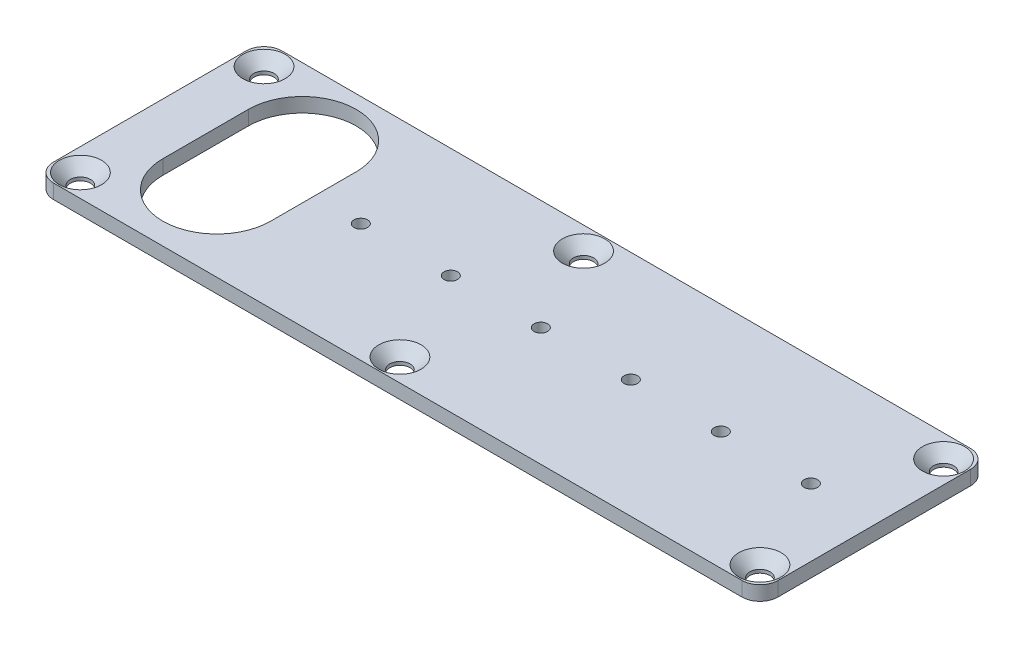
ISO-10303-21;
HEADER;
FILE_DESCRIPTION(('STEP AP214'),'2;1');
FILE_NAME('part.step','',(''),(''),'','','');
FILE_SCHEMA(('AUTOMOTIVE_DESIGN { 1 0 10303 214 1 1 1 1 }'));
ENDSEC;
DATA;
#1=APPLICATION_CONTEXT('core data for automotive mechanical design processes');
#2=APPLICATION_PROTOCOL_DEFINITION('international standard','automotive_design',2000,#1);
#3=PRODUCT_CONTEXT('',#1,'mechanical');
#4=PRODUCT('Part','Part','',(#3));
#5=PRODUCT_RELATED_PRODUCT_CATEGORY('part','',(#4));
#6=PRODUCT_DEFINITION_FORMATION('','',#4);
#7=PRODUCT_DEFINITION_CONTEXT('part definition',#1,'design');
#8=PRODUCT_DEFINITION('design','',#6,#7);
#9=PRODUCT_DEFINITION_SHAPE('','',#8);
#10=(LENGTH_UNIT() NAMED_UNIT(*) SI_UNIT(.MILLI.,.METRE.));
#11=(NAMED_UNIT(*) PLANE_ANGLE_UNIT() SI_UNIT($,.RADIAN.));
#12=(NAMED_UNIT(*) SI_UNIT($,.STERADIAN.) SOLID_ANGLE_UNIT());
#13=UNCERTAINTY_MEASURE_WITH_UNIT(LENGTH_MEASURE(1.E-05),#10,'distance_accuracy_value','');
#14=(GEOMETRIC_REPRESENTATION_CONTEXT(3) GLOBAL_UNCERTAINTY_ASSIGNED_CONTEXT((#13)) GLOBAL_UNIT_ASSIGNED_CONTEXT((#10,
#11,#12)) REPRESENTATION_CONTEXT('',''));
#15=CARTESIAN_POINT('',(0.,0.,0.));
#16=DIRECTION('',(0.,0.,1.));
#17=DIRECTION('',(1.,0.,0.));
#18=AXIS2_PLACEMENT_3D('',#15,#16,#17);
#19=CARTESIAN_POINT('',(0.,3.2,0.));
#20=DIRECTION('',(1.,0.,0.));
#21=DIRECTION('',(0.,0.,-1.));
#22=AXIS2_PLACEMENT_3D('',#19,#20,#21);
#23=PLANE('',#22);
#24=DIRECTION('',(0.,0.,1.));
#25=VECTOR('',#24,1.);
#26=CARTESIAN_POINT('',(0.,0.,0.));
#27=LINE('',#26,#25);
#28=CARTESIAN_POINT('',(0.,0.,-46.8));
#29=VERTEX_POINT('',#28);
#30=CARTESIAN_POINT('',(0.,0.,-4.));
#31=VERTEX_POINT('',#30);
#32=EDGE_CURVE('E207',#29,#31,#27,.T.);
#33=ORIENTED_EDGE('',*,*,#32,.T.);
#34=DIRECTION('',(0.,-1.,0.));
#35=VECTOR('',#34,1.);
#36=CARTESIAN_POINT('',(0.,3.2,-4.));
#37=LINE('',#36,#35);
#38=CARTESIAN_POINT('',(0.,3.2,-4.));
#39=VERTEX_POINT('',#38);
#40=EDGE_CURVE('E258',#31,#39,#37,.F.);
#41=ORIENTED_EDGE('',*,*,#40,.T.);
#42=DIRECTION('',(0.,0.,1.));
#43=VECTOR('',#42,1.);
#44=CARTESIAN_POINT('',(0.,3.2,0.));
#45=LINE('',#44,#43);
#46=CARTESIAN_POINT('',(0.,3.2,-46.8));
#47=VERTEX_POINT('',#46);
#48=EDGE_CURVE('E210',#47,#39,#45,.T.);
#49=ORIENTED_EDGE('',*,*,#48,.F.);
#50=DIRECTION('',(0.,-1.,0.));
#51=VECTOR('',#50,1.);
#52=CARTESIAN_POINT('',(0.,3.2,-46.8));
#53=LINE('',#52,#51);
#54=EDGE_CURVE('E255',#47,#29,#53,.T.);
#55=ORIENTED_EDGE('',*,*,#54,.T.);
#56=EDGE_LOOP('',(#33,#41,#49,#55));
#57=FACE_BOUND('',#56,.T.);
#58=ADVANCED_FACE('F35',(#57),#23,.F.);
#59=CARTESIAN_POINT('',(0.,3.2,0.));
#60=DIRECTION('',(0.,0.,-1.));
#61=DIRECTION('',(-1.,0.,0.));
#62=AXIS2_PLACEMENT_3D('',#59,#60,#61);
#63=PLANE('',#62);
#64=DIRECTION('',(1.,0.,0.));
#65=VECTOR('',#64,1.);
#66=CARTESIAN_POINT('',(0.,0.,0.));
#67=LINE('',#66,#65);
#68=CARTESIAN_POINT('',(4.,0.,0.));
#69=VERTEX_POINT('',#68);
#70=CARTESIAN_POINT('',(157.,0.,0.));
#71=VERTEX_POINT('',#70);
#72=EDGE_CURVE('E224',#69,#71,#67,.T.);
#73=ORIENTED_EDGE('',*,*,#72,.T.);
#74=DIRECTION('',(0.,-1.,0.));
#75=VECTOR('',#74,1.);
#76=CARTESIAN_POINT('',(157.,3.2,0.));
#77=LINE('',#76,#75);
#78=CARTESIAN_POINT('',(157.,3.2,0.));
#79=VERTEX_POINT('',#78);
#80=EDGE_CURVE('E246',#71,#79,#77,.F.);
#81=ORIENTED_EDGE('',*,*,#80,.T.);
#82=DIRECTION('',(1.,0.,0.));
#83=VECTOR('',#82,1.);
#84=CARTESIAN_POINT('',(0.,3.2,0.));
#85=LINE('',#84,#83);
#86=CARTESIAN_POINT('',(4.,3.2,0.));
#87=VERTEX_POINT('',#86);
#88=EDGE_CURVE('E213',#87,#79,#85,.T.);
#89=ORIENTED_EDGE('',*,*,#88,.F.);
#90=DIRECTION('',(0.,-1.,0.));
#91=VECTOR('',#90,1.);
#92=CARTESIAN_POINT('',(4.,3.2,0.));
#93=LINE('',#92,#91);
#94=EDGE_CURVE('E243',#87,#69,#93,.T.);
#95=ORIENTED_EDGE('',*,*,#94,.T.);
#96=EDGE_LOOP('',(#73,#81,#89,#95));
#97=FACE_BOUND('',#96,.T.);
#98=ADVANCED_FACE('F326',(#97),#63,.F.);
#99=CARTESIAN_POINT('',(161.,3.2,0.));
#100=DIRECTION('',(-1.,0.,0.));
#101=DIRECTION('',(0.,0.,1.));
#102=AXIS2_PLACEMENT_3D('',#99,#100,#101);
#103=PLANE('',#102);
#104=DIRECTION('',(0.,0.,-1.));
#105=VECTOR('',#104,1.);
#106=CARTESIAN_POINT('',(161.,3.2,0.));
#107=LINE('',#106,#105);
#108=CARTESIAN_POINT('',(161.,3.2,-4.));
#109=VERTEX_POINT('',#108);
#110=CARTESIAN_POINT('',(161.,3.2,-46.8));
#111=VERTEX_POINT('',#110);
#112=EDGE_CURVE('E217',#109,#111,#107,.T.);
#113=ORIENTED_EDGE('',*,*,#112,.F.);
#114=DIRECTION('',(0.,-1.,0.));
#115=VECTOR('',#114,1.);
#116=CARTESIAN_POINT('',(161.,3.2,-4.));
#117=LINE('',#116,#115);
#118=CARTESIAN_POINT('',(161.,0.,-4.));
#119=VERTEX_POINT('',#118);
#120=EDGE_CURVE('E232',#109,#119,#117,.T.);
#121=ORIENTED_EDGE('',*,*,#120,.T.);
#122=DIRECTION('',(0.,0.,-1.));
#123=VECTOR('',#122,1.);
#124=CARTESIAN_POINT('',(161.,0.,0.));
#125=LINE('',#124,#123);
#126=CARTESIAN_POINT('',(161.,0.,-46.8));
#127=VERTEX_POINT('',#126);
#128=EDGE_CURVE('E227',#119,#127,#125,.T.);
#129=ORIENTED_EDGE('',*,*,#128,.T.);
#130=DIRECTION('',(0.,-1.,0.));
#131=VECTOR('',#130,1.);
#132=CARTESIAN_POINT('',(161.,3.2,-46.8));
#133=LINE('',#132,#131);
#134=EDGE_CURVE('E221',#127,#111,#133,.F.);
#135=ORIENTED_EDGE('',*,*,#134,.T.);
#136=EDGE_LOOP('',(#113,#121,#129,#135));
#137=FACE_BOUND('',#136,.T.);
#138=ADVANCED_FACE('F332',(#137),#103,.F.);
#139=CARTESIAN_POINT('',(0.,3.2,-50.8));
#140=DIRECTION('',(0.,0.,1.));
#141=DIRECTION('',(1.,0.,0.));
#142=AXIS2_PLACEMENT_3D('',#139,#140,#141);
#143=PLANE('',#142);
#144=DIRECTION('',(-1.,0.,0.));
#145=VECTOR('',#144,1.);
#146=CARTESIAN_POINT('',(0.,0.,-50.8));
#147=LINE('',#146,#145);
#148=CARTESIAN_POINT('',(157.,0.,-50.8));
#149=VERTEX_POINT('',#148);
#150=CARTESIAN_POINT('',(4.,0.,-50.8));
#151=VERTEX_POINT('',#150);
#152=EDGE_CURVE('E214',#149,#151,#147,.T.);
#153=ORIENTED_EDGE('',*,*,#152,.T.);
#154=DIRECTION('',(0.,-1.,0.));
#155=VECTOR('',#154,1.);
#156=CARTESIAN_POINT('',(4.,3.2,-50.8));
#157=LINE('',#156,#155);
#158=CARTESIAN_POINT('',(4.,3.2,-50.8));
#159=VERTEX_POINT('',#158);
#160=EDGE_CURVE('E11',#151,#159,#157,.F.);
#161=ORIENTED_EDGE('',*,*,#160,.T.);
#162=DIRECTION('',(-1.,0.,0.));
#163=VECTOR('',#162,1.);
#164=CARTESIAN_POINT('',(0.,3.2,-50.8));
#165=LINE('',#164,#163);
#166=CARTESIAN_POINT('',(157.,3.2,-50.8));
#167=VERTEX_POINT('',#166);
#168=EDGE_CURVE('E219',#167,#159,#165,.T.);
#169=ORIENTED_EDGE('',*,*,#168,.F.);
#170=DIRECTION('',(0.,-1.,0.));
#171=VECTOR('',#170,1.);
#172=CARTESIAN_POINT('',(157.,3.2,-50.8));
#173=LINE('',#172,#171);
#174=EDGE_CURVE('E44',#167,#149,#173,.T.);
#175=ORIENTED_EDGE('',*,*,#174,.T.);
#176=EDGE_LOOP('',(#153,#161,#169,#175));
#177=FACE_BOUND('',#176,.T.);
#178=ADVANCED_FACE('F370',(#177),#143,.F.);
#179=CARTESIAN_POINT('',(0.,3.2,0.));
#180=DIRECTION('',(0.,-1.,0.));
#181=DIRECTION('',(0.,0.,-1.));
#182=AXIS2_PLACEMENT_3D('',#179,#180,#181);
#183=PLANE('',#182);
#184=CARTESIAN_POINT('',(156.,3.2,-5.));
#185=DIRECTION('',(0.,1.,0.));
#186=DIRECTION('',(0.,0.,1.));
#187=AXIS2_PLACEMENT_3D('',#184,#185,#186);
#188=CIRCLE('',#187,4.70000000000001);
#189=CARTESIAN_POINT('',(156.,3.2,-0.29999999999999));
#190=VERTEX_POINT('',#189);
#191=EDGE_CURVE('E611',#190,#190,#188,.T.);
#192=ORIENTED_EDGE('',*,*,#191,.F.);
#193=EDGE_LOOP('',(#192));
#194=FACE_BOUND('',#193,.T.);
#195=CARTESIAN_POINT('',(76.,3.2,-5.));
#196=DIRECTION('',(0.,1.,0.));
#197=DIRECTION('',(0.,0.,1.));
#198=AXIS2_PLACEMENT_3D('',#195,#196,#197);
#199=CIRCLE('',#198,4.7);
#200=CARTESIAN_POINT('',(76.,3.2,-0.300000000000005));
#201=VERTEX_POINT('',#200);
#202=EDGE_CURVE('E287',#201,#201,#199,.T.);
#203=ORIENTED_EDGE('',*,*,#202,.F.);
#204=EDGE_LOOP('',(#203));
#205=FACE_BOUND('',#204,.T.);
#206=CARTESIAN_POINT('',(5.,3.2,-5.));
#207=DIRECTION('',(0.,1.,0.));
#208=DIRECTION('',(0.,0.,1.));
#209=AXIS2_PLACEMENT_3D('',#206,#207,#208);
#210=CIRCLE('',#209,4.7);
#211=CARTESIAN_POINT('',(5.,3.2,-0.300000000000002));
#212=VERTEX_POINT('',#211);
#213=EDGE_CURVE('E280',#212,#212,#210,.T.);
#214=ORIENTED_EDGE('',*,*,#213,.F.);
#215=EDGE_LOOP('',(#214));
#216=FACE_BOUND('',#215,.T.);
#217=CARTESIAN_POINT('',(5.,3.2,-45.8));
#218=DIRECTION('',(0.,1.,0.));
#219=DIRECTION('',(0.,0.,1.));
#220=AXIS2_PLACEMENT_3D('',#217,#218,#219);
#221=CIRCLE('',#220,4.7);
#222=CARTESIAN_POINT('',(5.,3.2,-41.1));
#223=VERTEX_POINT('',#222);
#224=EDGE_CURVE('E276',#223,#223,#221,.T.);
#225=ORIENTED_EDGE('',*,*,#224,.F.);
#226=EDGE_LOOP('',(#225));
#227=FACE_BOUND('',#226,.T.);
#228=CARTESIAN_POINT('',(76.,3.2,-45.8));
#229=DIRECTION('',(0.,1.,0.));
#230=DIRECTION('',(0.,0.,1.));
#231=AXIS2_PLACEMENT_3D('',#228,#229,#230);
#232=CIRCLE('',#231,4.7);
#233=CARTESIAN_POINT('',(76.,3.2,-41.1));
#234=VERTEX_POINT('',#233);
#235=EDGE_CURVE('E272',#234,#234,#232,.T.);
#236=ORIENTED_EDGE('',*,*,#235,.F.);
#237=EDGE_LOOP('',(#236));
#238=FACE_BOUND('',#237,.T.);
#239=CARTESIAN_POINT('',(156.,3.2,-45.8));
#240=DIRECTION('',(0.,1.,0.));
#241=DIRECTION('',(0.,0.,1.));
#242=AXIS2_PLACEMENT_3D('',#239,#240,#241);
#243=CIRCLE('',#242,4.70000000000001);
#244=CARTESIAN_POINT('',(156.,3.2,-41.1));
#245=VERTEX_POINT('',#244);
#246=EDGE_CURVE('E267',#245,#245,#243,.T.);
#247=ORIENTED_EDGE('',*,*,#246,.F.);
#248=EDGE_LOOP('',(#247));
#249=FACE_BOUND('',#248,.T.);
#250=DIRECTION('',(0.,0.,1.));
#251=VECTOR('',#250,1.);
#252=CARTESIAN_POINT('',(11.5,3.2,-35.8));
#253=LINE('',#252,#251);
#254=CARTESIAN_POINT('',(11.5,3.2,-35.8));
#255=VERTEX_POINT('',#254);
#256=CARTESIAN_POINT('',(11.5,3.2,-16.8));
#257=VERTEX_POINT('',#256);
#258=EDGE_CURVE('E163',#255,#257,#253,.T.);
#259=ORIENTED_EDGE('',*,*,#258,.F.);
#260=CARTESIAN_POINT('',(23.5,3.2,-35.8));
#261=DIRECTION('',(0.,1.,0.));
#262=DIRECTION('',(0.,0.,1.));
#263=AXIS2_PLACEMENT_3D('',#260,#261,#262);
#264=CIRCLE('',#263,12.);
#265=CARTESIAN_POINT('',(35.5,3.2,-35.8));
#266=VERTEX_POINT('',#265);
#267=EDGE_CURVE('E133',#266,#255,#264,.T.);
#268=ORIENTED_EDGE('',*,*,#267,.F.);
#269=DIRECTION('',(0.,0.,-1.));
#270=VECTOR('',#269,1.);
#271=CARTESIAN_POINT('',(35.5,3.2,-35.8));
#272=LINE('',#271,#270);
#273=CARTESIAN_POINT('',(35.5,3.2,-16.8));
#274=VERTEX_POINT('',#273);
#275=EDGE_CURVE('E151',#274,#266,#272,.T.);
#276=ORIENTED_EDGE('',*,*,#275,.F.);
#277=CARTESIAN_POINT('',(23.5,3.2,-16.8));
#278=DIRECTION('',(0.,1.,0.));
#279=DIRECTION('',(0.,0.,1.));
#280=AXIS2_PLACEMENT_3D('',#277,#278,#279);
#281=CIRCLE('',#280,12.);
#282=EDGE_CURVE('E154',#257,#274,#281,.T.);
#283=ORIENTED_EDGE('',*,*,#282,.F.);
#284=EDGE_LOOP('',(#259,#268,#276,#283));
#285=FACE_BOUND('',#284,.T.);
#286=CARTESIAN_POINT('',(46.,3.2,-26.3));
#287=DIRECTION('',(0.,1.,0.));
#288=DIRECTION('',(0.,0.,1.));
#289=AXIS2_PLACEMENT_3D('',#286,#287,#288);
#290=CIRCLE('',#289,1.5);
#291=CARTESIAN_POINT('',(46.,3.2,-24.8));
#292=VERTEX_POINT('',#291);
#293=EDGE_CURVE('E170',#292,#292,#290,.T.);
#294=ORIENTED_EDGE('',*,*,#293,.F.);
#295=EDGE_LOOP('',(#294));
#296=FACE_BOUND('',#295,.T.);
#297=CARTESIAN_POINT('',(66.,3.2,-26.3));
#298=DIRECTION('',(0.,1.,0.));
#299=DIRECTION('',(0.,0.,1.));
#300=AXIS2_PLACEMENT_3D('',#297,#298,#299);
#301=CIRCLE('',#300,1.5);
#302=CARTESIAN_POINT('',(66.,3.2,-24.8));
#303=VERTEX_POINT('',#302);
#304=EDGE_CURVE('E177',#303,#303,#301,.T.);
#305=ORIENTED_EDGE('',*,*,#304,.F.);
#306=EDGE_LOOP('',(#305));
#307=FACE_BOUND('',#306,.T.);
#308=CARTESIAN_POINT('',(86.,3.2,-26.3));
#309=DIRECTION('',(0.,1.,0.));
#310=DIRECTION('',(0.,0.,1.));
#311=AXIS2_PLACEMENT_3D('',#308,#309,#310);
#312=CIRCLE('',#311,1.5);
#313=CARTESIAN_POINT('',(86.,3.2,-24.8));
#314=VERTEX_POINT('',#313);
#315=EDGE_CURVE('E183',#314,#314,#312,.T.);
#316=ORIENTED_EDGE('',*,*,#315,.F.);
#317=EDGE_LOOP('',(#316));
#318=FACE_BOUND('',#317,.T.);
#319=CARTESIAN_POINT('',(126.,3.2,-26.3));
#320=DIRECTION('',(0.,1.,0.));
#321=DIRECTION('',(0.,0.,1.));
#322=AXIS2_PLACEMENT_3D('',#319,#320,#321);
#323=CIRCLE('',#322,1.5);
#324=CARTESIAN_POINT('',(126.,3.2,-24.8));
#325=VERTEX_POINT('',#324);
#326=EDGE_CURVE('E189',#325,#325,#323,.T.);
#327=ORIENTED_EDGE('',*,*,#326,.F.);
#328=EDGE_LOOP('',(#327));
#329=FACE_BOUND('',#328,.T.);
#330=CARTESIAN_POINT('',(106.,3.2,-26.3));
#331=DIRECTION('',(0.,1.,0.));
#332=DIRECTION('',(0.,0.,1.));
#333=AXIS2_PLACEMENT_3D('',#330,#331,#332);
#334=CIRCLE('',#333,1.5);
#335=CARTESIAN_POINT('',(106.,3.2,-24.8));
#336=VERTEX_POINT('',#335);
#337=EDGE_CURVE('E195',#336,#336,#334,.T.);
#338=ORIENTED_EDGE('',*,*,#337,.F.);
#339=EDGE_LOOP('',(#338));
#340=FACE_BOUND('',#339,.T.);
#341=CARTESIAN_POINT('',(146.,3.2,-26.3));
#342=DIRECTION('',(0.,1.,0.));
#343=DIRECTION('',(0.,0.,1.));
#344=AXIS2_PLACEMENT_3D('',#341,#342,#343);
#345=CIRCLE('',#344,1.5);
#346=CARTESIAN_POINT('',(146.,3.2,-24.8));
#347=VERTEX_POINT('',#346);
#348=EDGE_CURVE('E201',#347,#347,#345,.T.);
#349=ORIENTED_EDGE('',*,*,#348,.F.);
#350=EDGE_LOOP('',(#349));
#351=FACE_BOUND('',#350,.T.);
#352=ORIENTED_EDGE('',*,*,#88,.T.);
#353=CARTESIAN_POINT('',(157.,3.2,-4.));
#354=DIRECTION('',(0.,-1.,0.));
#355=DIRECTION('',(0.,0.,-1.));
#356=AXIS2_PLACEMENT_3D('',#353,#354,#355);
#357=CIRCLE('',#356,4.);
#358=EDGE_CURVE('E253',#79,#109,#357,.F.);
#359=ORIENTED_EDGE('',*,*,#358,.T.);
#360=ORIENTED_EDGE('',*,*,#112,.T.);
#361=CARTESIAN_POINT('',(157.,3.2,-46.8));
#362=DIRECTION('',(0.,-1.,0.));
#363=DIRECTION('',(0.,0.,-1.));
#364=AXIS2_PLACEMENT_3D('',#361,#362,#363);
#365=CIRCLE('',#364,4.);
#366=EDGE_CURVE('E57',#111,#167,#365,.F.);
#367=ORIENTED_EDGE('',*,*,#366,.T.);
#368=ORIENTED_EDGE('',*,*,#168,.T.);
#369=CARTESIAN_POINT('',(4.,3.2,-46.8));
#370=DIRECTION('',(0.,-1.,0.));
#371=DIRECTION('',(0.,0.,-1.));
#372=AXIS2_PLACEMENT_3D('',#369,#370,#371);
#373=CIRCLE('',#372,4.);
#374=EDGE_CURVE('E249',#159,#47,#373,.F.);
#375=ORIENTED_EDGE('',*,*,#374,.T.);
#376=ORIENTED_EDGE('',*,*,#48,.T.);
#377=CARTESIAN_POINT('',(4.,3.2,-4.));
#378=DIRECTION('',(0.,-1.,0.));
#379=DIRECTION('',(0.,0.,-1.));
#380=AXIS2_PLACEMENT_3D('',#377,#378,#379);
#381=CIRCLE('',#380,4.);
#382=EDGE_CURVE('E251',#39,#87,#381,.F.);
#383=ORIENTED_EDGE('',*,*,#382,.T.);
#384=EDGE_LOOP('',(#352,#359,#360,#367,#368,#375,#376,#383));
#385=FACE_BOUND('',#384,.T.);
#386=ADVANCED_FACE('F354',(#194,#205,#216,#227,#238,#249,#285,#296,#307,#318,#329,#340,#351,
#385),#183,.F.);
#387=CARTESIAN_POINT('',(0.,0.,0.));
#388=DIRECTION('',(0.,-1.,0.));
#389=DIRECTION('',(0.,0.,-1.));
#390=AXIS2_PLACEMENT_3D('',#387,#388,#389);
#391=PLANE('',#390);
#392=CARTESIAN_POINT('',(156.,0.,-5.));
#393=DIRECTION('',(0.,-1.,0.));
#394=DIRECTION('',(0.,0.,-1.));
#395=AXIS2_PLACEMENT_3D('',#392,#393,#394);
#396=CIRCLE('',#395,2.25);
#397=CARTESIAN_POINT('',(156.,0.,-7.25));
#398=VERTEX_POINT('',#397);
#399=EDGE_CURVE('E39',#398,#398,#396,.T.);
#400=ORIENTED_EDGE('',*,*,#399,.F.);
#401=EDGE_LOOP('',(#400));
#402=FACE_BOUND('',#401,.T.);
#403=CARTESIAN_POINT('',(76.,0.,-5.));
#404=DIRECTION('',(0.,-1.,0.));
#405=DIRECTION('',(0.,0.,-1.));
#406=AXIS2_PLACEMENT_3D('',#403,#404,#405);
#407=CIRCLE('',#406,2.25);
#408=CARTESIAN_POINT('',(76.,0.,-7.25));
#409=VERTEX_POINT('',#408);
#410=EDGE_CURVE('E278',#409,#409,#407,.T.);
#411=ORIENTED_EDGE('',*,*,#410,.F.);
#412=EDGE_LOOP('',(#411));
#413=FACE_BOUND('',#412,.T.);
#414=CARTESIAN_POINT('',(5.,0.,-5.));
#415=DIRECTION('',(0.,-1.,0.));
#416=DIRECTION('',(0.,0.,-1.));
#417=AXIS2_PLACEMENT_3D('',#414,#415,#416);
#418=CIRCLE('',#417,2.24999999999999);
#419=CARTESIAN_POINT('',(5.,0.,-7.25));
#420=VERTEX_POINT('',#419);
#421=EDGE_CURVE('E274',#420,#420,#418,.T.);
#422=ORIENTED_EDGE('',*,*,#421,.F.);
#423=EDGE_LOOP('',(#422));
#424=FACE_BOUND('',#423,.T.);
#425=CARTESIAN_POINT('',(5.,0.,-45.8));
#426=DIRECTION('',(0.,-1.,0.));
#427=DIRECTION('',(0.,0.,-1.));
#428=AXIS2_PLACEMENT_3D('',#425,#426,#427);
#429=CIRCLE('',#428,2.24999999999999);
#430=CARTESIAN_POINT('',(5.,0.,-48.05));
#431=VERTEX_POINT('',#430);
#432=EDGE_CURVE('E269',#431,#431,#429,.T.);
#433=ORIENTED_EDGE('',*,*,#432,.F.);
#434=EDGE_LOOP('',(#433));
#435=FACE_BOUND('',#434,.T.);
#436=CARTESIAN_POINT('',(76.,0.,-45.8));
#437=DIRECTION('',(0.,-1.,0.));
#438=DIRECTION('',(0.,0.,-1.));
#439=AXIS2_PLACEMENT_3D('',#436,#437,#438);
#440=CIRCLE('',#439,2.25);
#441=CARTESIAN_POINT('',(76.,0.,-48.05));
#442=VERTEX_POINT('',#441);
#443=EDGE_CURVE('E264',#442,#442,#440,.T.);
#444=ORIENTED_EDGE('',*,*,#443,.F.);
#445=EDGE_LOOP('',(#444));
#446=FACE_BOUND('',#445,.T.);
#447=CARTESIAN_POINT('',(156.,0.,-45.8));
#448=DIRECTION('',(0.,-1.,0.));
#449=DIRECTION('',(0.,0.,-1.));
#450=AXIS2_PLACEMENT_3D('',#447,#448,#449);
#451=CIRCLE('',#450,2.25);
#452=CARTESIAN_POINT('',(156.,0.,-48.05));
#453=VERTEX_POINT('',#452);
#454=EDGE_CURVE('E164',#453,#453,#451,.T.);
#455=ORIENTED_EDGE('',*,*,#454,.F.);
#456=EDGE_LOOP('',(#455));
#457=FACE_BOUND('',#456,.T.);
#458=CARTESIAN_POINT('',(23.5,0.,-35.8));
#459=DIRECTION('',(0.,1.,0.));
#460=DIRECTION('',(0.,0.,1.));
#461=AXIS2_PLACEMENT_3D('',#458,#459,#460);
#462=CIRCLE('',#461,12.);
#463=CARTESIAN_POINT('',(35.5,0.,-35.8));
#464=VERTEX_POINT('',#463);
#465=CARTESIAN_POINT('',(11.5,0.,-35.8));
#466=VERTEX_POINT('',#465);
#467=EDGE_CURVE('E130',#464,#466,#462,.T.);
#468=ORIENTED_EDGE('',*,*,#467,.T.);
#469=DIRECTION('',(0.,0.,1.));
#470=VECTOR('',#469,1.);
#471=CARTESIAN_POINT('',(11.5,0.,-35.8));
#472=LINE('',#471,#470);
#473=CARTESIAN_POINT('',(11.5,0.,-16.8));
#474=VERTEX_POINT('',#473);
#475=EDGE_CURVE('E142',#466,#474,#472,.T.);
#476=ORIENTED_EDGE('',*,*,#475,.T.);
#477=CARTESIAN_POINT('',(23.5,0.,-16.8));
#478=DIRECTION('',(0.,1.,0.));
#479=DIRECTION('',(0.,0.,1.));
#480=AXIS2_PLACEMENT_3D('',#477,#478,#479);
#481=CIRCLE('',#480,12.);
#482=CARTESIAN_POINT('',(35.5,0.,-16.8));
#483=VERTEX_POINT('',#482);
#484=EDGE_CURVE('E146',#474,#483,#481,.T.);
#485=ORIENTED_EDGE('',*,*,#484,.T.);
#486=DIRECTION('',(0.,0.,-1.));
#487=VECTOR('',#486,1.);
#488=CARTESIAN_POINT('',(35.5,0.,-35.8));
#489=LINE('',#488,#487);
#490=EDGE_CURVE('E138',#483,#464,#489,.T.);
#491=ORIENTED_EDGE('',*,*,#490,.T.);
#492=EDGE_LOOP('',(#468,#476,#485,#491));
#493=FACE_BOUND('',#492,.T.);
#494=CARTESIAN_POINT('',(46.,0.,-26.3));
#495=DIRECTION('',(0.,1.,0.));
#496=DIRECTION('',(0.,0.,1.));
#497=AXIS2_PLACEMENT_3D('',#494,#495,#496);
#498=CIRCLE('',#497,1.5);
#499=CARTESIAN_POINT('',(46.,0.,-24.8));
#500=VERTEX_POINT('',#499);
#501=EDGE_CURVE('E174',#500,#500,#498,.T.);
#502=ORIENTED_EDGE('',*,*,#501,.T.);
#503=EDGE_LOOP('',(#502));
#504=FACE_BOUND('',#503,.T.);
#505=CARTESIAN_POINT('',(66.,0.,-26.3));
#506=DIRECTION('',(0.,1.,0.));
#507=DIRECTION('',(0.,0.,1.));
#508=AXIS2_PLACEMENT_3D('',#505,#506,#507);
#509=CIRCLE('',#508,1.5);
#510=CARTESIAN_POINT('',(66.,0.,-24.8));
#511=VERTEX_POINT('',#510);
#512=EDGE_CURVE('E180',#511,#511,#509,.T.);
#513=ORIENTED_EDGE('',*,*,#512,.T.);
#514=EDGE_LOOP('',(#513));
#515=FACE_BOUND('',#514,.T.);
#516=CARTESIAN_POINT('',(86.,0.,-26.3));
#517=DIRECTION('',(0.,1.,0.));
#518=DIRECTION('',(0.,0.,1.));
#519=AXIS2_PLACEMENT_3D('',#516,#517,#518);
#520=CIRCLE('',#519,1.5);
#521=CARTESIAN_POINT('',(86.,0.,-24.8));
#522=VERTEX_POINT('',#521);
#523=EDGE_CURVE('E186',#522,#522,#520,.T.);
#524=ORIENTED_EDGE('',*,*,#523,.T.);
#525=EDGE_LOOP('',(#524));
#526=FACE_BOUND('',#525,.T.);
#527=CARTESIAN_POINT('',(126.,0.,-26.3));
#528=DIRECTION('',(0.,1.,0.));
#529=DIRECTION('',(0.,0.,1.));
#530=AXIS2_PLACEMENT_3D('',#527,#528,#529);
#531=CIRCLE('',#530,1.5);
#532=CARTESIAN_POINT('',(126.,0.,-24.8));
#533=VERTEX_POINT('',#532);
#534=EDGE_CURVE('E192',#533,#533,#531,.T.);
#535=ORIENTED_EDGE('',*,*,#534,.T.);
#536=EDGE_LOOP('',(#535));
#537=FACE_BOUND('',#536,.T.);
#538=CARTESIAN_POINT('',(106.,0.,-26.3));
#539=DIRECTION('',(0.,1.,0.));
#540=DIRECTION('',(0.,0.,1.));
#541=AXIS2_PLACEMENT_3D('',#538,#539,#540);
#542=CIRCLE('',#541,1.5);
#543=CARTESIAN_POINT('',(106.,0.,-24.8));
#544=VERTEX_POINT('',#543);
#545=EDGE_CURVE('E198',#544,#544,#542,.T.);
#546=ORIENTED_EDGE('',*,*,#545,.T.);
#547=EDGE_LOOP('',(#546));
#548=FACE_BOUND('',#547,.T.);
#549=CARTESIAN_POINT('',(146.,0.,-26.3));
#550=DIRECTION('',(0.,1.,0.));
#551=DIRECTION('',(0.,0.,1.));
#552=AXIS2_PLACEMENT_3D('',#549,#550,#551);
#553=CIRCLE('',#552,1.5);
#554=CARTESIAN_POINT('',(146.,0.,-24.8));
#555=VERTEX_POINT('',#554);
#556=EDGE_CURVE('E204',#555,#555,#553,.T.);
#557=ORIENTED_EDGE('',*,*,#556,.T.);
#558=EDGE_LOOP('',(#557));
#559=FACE_BOUND('',#558,.T.);
#560=ORIENTED_EDGE('',*,*,#128,.F.);
#561=CARTESIAN_POINT('',(157.,0.,-4.));
#562=DIRECTION('',(0.,-1.,0.));
#563=DIRECTION('',(0.,0.,-1.));
#564=AXIS2_PLACEMENT_3D('',#561,#562,#563);
#565=CIRCLE('',#564,4.);
#566=EDGE_CURVE('E241',#119,#71,#565,.T.);
#567=ORIENTED_EDGE('',*,*,#566,.T.);
#568=ORIENTED_EDGE('',*,*,#72,.F.);
#569=CARTESIAN_POINT('',(4.,0.,-4.));
#570=DIRECTION('',(0.,-1.,0.));
#571=DIRECTION('',(0.,0.,-1.));
#572=AXIS2_PLACEMENT_3D('',#569,#570,#571);
#573=CIRCLE('',#572,4.);
#574=EDGE_CURVE('E239',#69,#31,#573,.T.);
#575=ORIENTED_EDGE('',*,*,#574,.T.);
#576=ORIENTED_EDGE('',*,*,#32,.F.);
#577=CARTESIAN_POINT('',(4.,0.,-46.8));
#578=DIRECTION('',(0.,-1.,0.));
#579=DIRECTION('',(0.,0.,-1.));
#580=AXIS2_PLACEMENT_3D('',#577,#578,#579);
#581=CIRCLE('',#580,4.);
#582=EDGE_CURVE('E237',#29,#151,#581,.T.);
#583=ORIENTED_EDGE('',*,*,#582,.T.);
#584=ORIENTED_EDGE('',*,*,#152,.F.);
#585=CARTESIAN_POINT('',(157.,0.,-46.8));
#586=DIRECTION('',(0.,-1.,0.));
#587=DIRECTION('',(0.,0.,-1.));
#588=AXIS2_PLACEMENT_3D('',#585,#586,#587);
#589=CIRCLE('',#588,4.);
#590=EDGE_CURVE('E235',#149,#127,#589,.T.);
#591=ORIENTED_EDGE('',*,*,#590,.T.);
#592=EDGE_LOOP('',(#560,#567,#568,#575,#576,#583,#584,#591));
#593=FACE_BOUND('',#592,.T.);
#594=ADVANCED_FACE('F148',(#402,#413,#424,#435,#446,#457,#493,#504,#515,#526,#537,#548,#559,
#593),#391,.T.);
#595=CARTESIAN_POINT('',(146.,0.,-26.3));
#596=DIRECTION('',(0.,1.,0.));
#597=DIRECTION('',(0.,0.,1.));
#598=AXIS2_PLACEMENT_3D('',#595,#596,#597);
#599=CYLINDRICAL_SURFACE('',#598,1.5);
#600=ORIENTED_EDGE('',*,*,#556,.F.);
#601=EDGE_LOOP('',(#600));
#602=FACE_BOUND('',#601,.T.);
#603=ORIENTED_EDGE('',*,*,#348,.T.);
#604=EDGE_LOOP('',(#603));
#605=FACE_BOUND('',#604,.T.);
#606=ADVANCED_FACE('F373',(#602,#605),#599,.F.);
#607=CARTESIAN_POINT('',(106.,0.,-26.3));
#608=DIRECTION('',(0.,1.,0.));
#609=DIRECTION('',(0.,0.,1.));
#610=AXIS2_PLACEMENT_3D('',#607,#608,#609);
#611=CYLINDRICAL_SURFACE('',#610,1.5);
#612=ORIENTED_EDGE('',*,*,#545,.F.);
#613=EDGE_LOOP('',(#612));
#614=FACE_BOUND('',#613,.T.);
#615=ORIENTED_EDGE('',*,*,#337,.T.);
#616=EDGE_LOOP('',(#615));
#617=FACE_BOUND('',#616,.T.);
#618=ADVANCED_FACE('F381',(#614,#617),#611,.F.);
#619=CARTESIAN_POINT('',(126.,0.,-26.3));
#620=DIRECTION('',(0.,1.,0.));
#621=DIRECTION('',(0.,0.,1.));
#622=AXIS2_PLACEMENT_3D('',#619,#620,#621);
#623=CYLINDRICAL_SURFACE('',#622,1.5);
#624=ORIENTED_EDGE('',*,*,#534,.F.);
#625=EDGE_LOOP('',(#624));
#626=FACE_BOUND('',#625,.T.);
#627=ORIENTED_EDGE('',*,*,#326,.T.);
#628=EDGE_LOOP('',(#627));
#629=FACE_BOUND('',#628,.T.);
#630=ADVANCED_FACE('F421',(#626,#629),#623,.F.);
#631=CARTESIAN_POINT('',(86.,0.,-26.3));
#632=DIRECTION('',(0.,1.,0.));
#633=DIRECTION('',(0.,0.,1.));
#634=AXIS2_PLACEMENT_3D('',#631,#632,#633);
#635=CYLINDRICAL_SURFACE('',#634,1.5);
#636=ORIENTED_EDGE('',*,*,#523,.F.);
#637=EDGE_LOOP('',(#636));
#638=FACE_BOUND('',#637,.T.);
#639=ORIENTED_EDGE('',*,*,#315,.T.);
#640=EDGE_LOOP('',(#639));
#641=FACE_BOUND('',#640,.T.);
#642=ADVANCED_FACE('F429',(#638,#641),#635,.F.);
#643=CARTESIAN_POINT('',(66.,0.,-26.3));
#644=DIRECTION('',(0.,1.,0.));
#645=DIRECTION('',(0.,0.,1.));
#646=AXIS2_PLACEMENT_3D('',#643,#644,#645);
#647=CYLINDRICAL_SURFACE('',#646,1.5);
#648=ORIENTED_EDGE('',*,*,#512,.F.);
#649=EDGE_LOOP('',(#648));
#650=FACE_BOUND('',#649,.T.);
#651=ORIENTED_EDGE('',*,*,#304,.T.);
#652=EDGE_LOOP('',(#651));
#653=FACE_BOUND('',#652,.T.);
#654=ADVANCED_FACE('F437',(#650,#653),#647,.F.);
#655=CARTESIAN_POINT('',(46.,0.,-26.3));
#656=DIRECTION('',(0.,1.,0.));
#657=DIRECTION('',(0.,0.,1.));
#658=AXIS2_PLACEMENT_3D('',#655,#656,#657);
#659=CYLINDRICAL_SURFACE('',#658,1.5);
#660=ORIENTED_EDGE('',*,*,#501,.F.);
#661=EDGE_LOOP('',(#660));
#662=FACE_BOUND('',#661,.T.);
#663=ORIENTED_EDGE('',*,*,#293,.T.);
#664=EDGE_LOOP('',(#663));
#665=FACE_BOUND('',#664,.T.);
#666=ADVANCED_FACE('F445',(#662,#665),#659,.F.);
#667=CARTESIAN_POINT('',(23.5,0.,-35.8));
#668=DIRECTION('',(0.,1.,0.));
#669=DIRECTION('',(0.,0.,1.));
#670=AXIS2_PLACEMENT_3D('',#667,#668,#669);
#671=CYLINDRICAL_SURFACE('',#670,12.);
#672=ORIENTED_EDGE('',*,*,#267,.T.);
#673=DIRECTION('',(0.,1.,0.));
#674=VECTOR('',#673,1.);
#675=CARTESIAN_POINT('',(11.5,0.,-35.8));
#676=LINE('',#675,#674);
#677=EDGE_CURVE('E126',#466,#255,#676,.T.);
#678=ORIENTED_EDGE('',*,*,#677,.F.);
#679=ORIENTED_EDGE('',*,*,#467,.F.);
#680=DIRECTION('',(0.,1.,0.));
#681=VECTOR('',#680,1.);
#682=CARTESIAN_POINT('',(35.5,0.,-35.8));
#683=LINE('',#682,#681);
#684=EDGE_CURVE('E168',#464,#266,#683,.T.);
#685=ORIENTED_EDGE('',*,*,#684,.T.);
#686=EDGE_LOOP('',(#672,#678,#679,#685));
#687=FACE_BOUND('',#686,.T.);
#688=ADVANCED_FACE('F128',(#687),#671,.F.);
#689=CARTESIAN_POINT('',(35.5,0.,-35.8));
#690=DIRECTION('',(1.,0.,0.));
#691=DIRECTION('',(0.,0.,-1.));
#692=AXIS2_PLACEMENT_3D('',#689,#690,#691);
#693=PLANE('',#692);
#694=ORIENTED_EDGE('',*,*,#275,.T.);
#695=ORIENTED_EDGE('',*,*,#684,.F.);
#696=ORIENTED_EDGE('',*,*,#490,.F.);
#697=DIRECTION('',(0.,1.,0.));
#698=VECTOR('',#697,1.);
#699=CARTESIAN_POINT('',(35.5,0.,-16.8));
#700=LINE('',#699,#698);
#701=EDGE_CURVE('E171',#483,#274,#700,.T.);
#702=ORIENTED_EDGE('',*,*,#701,.T.);
#703=EDGE_LOOP('',(#694,#695,#696,#702));
#704=FACE_BOUND('',#703,.T.);
#705=ADVANCED_FACE('F460',(#704),#693,.F.);
#706=CARTESIAN_POINT('',(23.5,0.,-16.8));
#707=DIRECTION('',(0.,1.,0.));
#708=DIRECTION('',(0.,0.,1.));
#709=AXIS2_PLACEMENT_3D('',#706,#707,#708);
#710=CYLINDRICAL_SURFACE('',#709,12.);
#711=ORIENTED_EDGE('',*,*,#282,.T.);
#712=ORIENTED_EDGE('',*,*,#701,.F.);
#713=ORIENTED_EDGE('',*,*,#484,.F.);
#714=DIRECTION('',(0.,1.,0.));
#715=VECTOR('',#714,1.);
#716=CARTESIAN_POINT('',(11.5,0.,-16.8));
#717=LINE('',#716,#715);
#718=EDGE_CURVE('E137',#474,#257,#717,.T.);
#719=ORIENTED_EDGE('',*,*,#718,.T.);
#720=EDGE_LOOP('',(#711,#712,#713,#719));
#721=FACE_BOUND('',#720,.T.);
#722=ADVANCED_FACE('F467',(#721),#710,.F.);
#723=CARTESIAN_POINT('',(11.5,0.,-35.8));
#724=DIRECTION('',(-1.,0.,0.));
#725=DIRECTION('',(0.,0.,1.));
#726=AXIS2_PLACEMENT_3D('',#723,#724,#725);
#727=PLANE('',#726);
#728=ORIENTED_EDGE('',*,*,#258,.T.);
#729=ORIENTED_EDGE('',*,*,#718,.F.);
#730=ORIENTED_EDGE('',*,*,#475,.F.);
#731=ORIENTED_EDGE('',*,*,#677,.T.);
#732=EDGE_LOOP('',(#728,#729,#730,#731));
#733=FACE_BOUND('',#732,.T.);
#734=ADVANCED_FACE('F143',(#733),#727,.F.);
#735=CARTESIAN_POINT('',(157.,3.2,-4.));
#736=DIRECTION('',(0.,-1.,0.));
#737=DIRECTION('',(0.,0.,-1.));
#738=AXIS2_PLACEMENT_3D('',#735,#736,#737);
#739=CYLINDRICAL_SURFACE('',#738,4.);
#740=ORIENTED_EDGE('',*,*,#358,.F.);
#741=ORIENTED_EDGE('',*,*,#80,.F.);
#742=ORIENTED_EDGE('',*,*,#566,.F.);
#743=ORIENTED_EDGE('',*,*,#120,.F.);
#744=EDGE_LOOP('',(#740,#741,#742,#743));
#745=FACE_BOUND('',#744,.T.);
#746=ADVANCED_FACE('F337',(#745),#739,.T.);
#747=CARTESIAN_POINT('',(4.,3.2,-4.));
#748=DIRECTION('',(0.,-1.,0.));
#749=DIRECTION('',(0.,0.,-1.));
#750=AXIS2_PLACEMENT_3D('',#747,#748,#749);
#751=CYLINDRICAL_SURFACE('',#750,4.);
#752=ORIENTED_EDGE('',*,*,#382,.F.);
#753=ORIENTED_EDGE('',*,*,#40,.F.);
#754=ORIENTED_EDGE('',*,*,#574,.F.);
#755=ORIENTED_EDGE('',*,*,#94,.F.);
#756=EDGE_LOOP('',(#752,#753,#754,#755));
#757=FACE_BOUND('',#756,.T.);
#758=ADVANCED_FACE('F340',(#757),#751,.T.);
#759=CARTESIAN_POINT('',(4.,3.2,-46.8));
#760=DIRECTION('',(0.,-1.,0.));
#761=DIRECTION('',(0.,0.,-1.));
#762=AXIS2_PLACEMENT_3D('',#759,#760,#761);
#763=CYLINDRICAL_SURFACE('',#762,4.);
#764=ORIENTED_EDGE('',*,*,#374,.F.);
#765=ORIENTED_EDGE('',*,*,#160,.F.);
#766=ORIENTED_EDGE('',*,*,#582,.F.);
#767=ORIENTED_EDGE('',*,*,#54,.F.);
#768=EDGE_LOOP('',(#764,#765,#766,#767));
#769=FACE_BOUND('',#768,.T.);
#770=ADVANCED_FACE('F343',(#769),#763,.T.);
#771=CARTESIAN_POINT('',(157.,3.2,-46.8));
#772=DIRECTION('',(0.,-1.,0.));
#773=DIRECTION('',(0.,0.,-1.));
#774=AXIS2_PLACEMENT_3D('',#771,#772,#773);
#775=CYLINDRICAL_SURFACE('',#774,4.);
#776=ORIENTED_EDGE('',*,*,#366,.F.);
#777=ORIENTED_EDGE('',*,*,#134,.F.);
#778=ORIENTED_EDGE('',*,*,#590,.F.);
#779=ORIENTED_EDGE('',*,*,#174,.F.);
#780=EDGE_LOOP('',(#776,#777,#778,#779));
#781=FACE_BOUND('',#780,.T.);
#782=ADVANCED_FACE('F37',(#781),#775,.T.);
#783=CARTESIAN_POINT('',(156.,3.2,-45.8));
#784=DIRECTION('',(0.,1.,0.));
#785=DIRECTION('',(0.,0.,1.));
#786=AXIS2_PLACEMENT_3D('',#783,#784,#785);
#787=CYLINDRICAL_SURFACE('',#786,2.25);
#788=ORIENTED_EDGE('',*,*,#454,.T.);
#789=EDGE_LOOP('',(#788));
#790=FACE_BOUND('',#789,.T.);
#791=CARTESIAN_POINT('',(156.,0.749999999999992,-45.8));
#792=DIRECTION('',(0.,1.,0.));
#793=DIRECTION('',(0.,0.,1.));
#794=AXIS2_PLACEMENT_3D('',#791,#792,#793);
#795=CIRCLE('',#794,2.25);
#796=CARTESIAN_POINT('',(156.,0.749999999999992,-43.55));
#797=VERTEX_POINT('',#796);
#798=EDGE_CURVE('E157',#797,#797,#795,.T.);
#799=ORIENTED_EDGE('',*,*,#798,.T.);
#800=EDGE_LOOP('',(#799));
#801=FACE_BOUND('',#800,.T.);
#802=ADVANCED_FACE('F310',(#790,#801),#787,.F.);
#803=CARTESIAN_POINT('',(156.,3.2,-45.8));
#804=DIRECTION('',(0.,1.,0.));
#805=DIRECTION('',(0.,0.,1.));
#806=AXIS2_PLACEMENT_3D('',#803,#804,#805);
#807=CONICAL_SURFACE('',#806,4.70000000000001,0.785398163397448);
#808=ORIENTED_EDGE('',*,*,#798,.F.);
#809=EDGE_LOOP('',(#808));
#810=FACE_BOUND('',#809,.T.);
#811=ORIENTED_EDGE('',*,*,#246,.T.);
#812=EDGE_LOOP('',(#811));
#813=FACE_BOUND('',#812,.T.);
#814=ADVANCED_FACE('F312',(#810,#813),#807,.F.);
#815=CARTESIAN_POINT('',(76.,3.2,-45.8));
#816=DIRECTION('',(0.,1.,0.));
#817=DIRECTION('',(0.,0.,1.));
#818=AXIS2_PLACEMENT_3D('',#815,#816,#817);
#819=CYLINDRICAL_SURFACE('',#818,2.25);
#820=ORIENTED_EDGE('',*,*,#443,.T.);
#821=EDGE_LOOP('',(#820));
#822=FACE_BOUND('',#821,.T.);
#823=CARTESIAN_POINT('',(76.,0.749999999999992,-45.8));
#824=DIRECTION('',(0.,1.,0.));
#825=DIRECTION('',(0.,0.,1.));
#826=AXIS2_PLACEMENT_3D('',#823,#824,#825);
#827=CIRCLE('',#826,2.24999999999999);
#828=CARTESIAN_POINT('',(76.,0.749999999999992,-43.55));
#829=VERTEX_POINT('',#828);
#830=EDGE_CURVE('E268',#829,#829,#827,.T.);
#831=ORIENTED_EDGE('',*,*,#830,.T.);
#832=EDGE_LOOP('',(#831));
#833=FACE_BOUND('',#832,.T.);
#834=ADVANCED_FACE('F314',(#822,#833),#819,.F.);
#835=CARTESIAN_POINT('',(76.,3.2,-45.8));
#836=DIRECTION('',(0.,1.,0.));
#837=DIRECTION('',(0.,0.,1.));
#838=AXIS2_PLACEMENT_3D('',#835,#836,#837);
#839=CONICAL_SURFACE('',#838,4.7,0.785398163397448);
#840=ORIENTED_EDGE('',*,*,#830,.F.);
#841=EDGE_LOOP('',(#840));
#842=FACE_BOUND('',#841,.T.);
#843=ORIENTED_EDGE('',*,*,#235,.T.);
#844=EDGE_LOOP('',(#843));
#845=FACE_BOUND('',#844,.T.);
#846=ADVANCED_FACE('F320',(#842,#845),#839,.F.);
#847=CARTESIAN_POINT('',(5.,3.2,-45.8));
#848=DIRECTION('',(0.,1.,0.));
#849=DIRECTION('',(0.,0.,1.));
#850=AXIS2_PLACEMENT_3D('',#847,#848,#849);
#851=CYLINDRICAL_SURFACE('',#850,2.24999999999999);
#852=ORIENTED_EDGE('',*,*,#432,.T.);
#853=EDGE_LOOP('',(#852));
#854=FACE_BOUND('',#853,.T.);
#855=CARTESIAN_POINT('',(5.,0.749999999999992,-45.8));
#856=DIRECTION('',(0.,1.,0.));
#857=DIRECTION('',(0.,0.,1.));
#858=AXIS2_PLACEMENT_3D('',#855,#856,#857);
#859=CIRCLE('',#858,2.24999999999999);
#860=CARTESIAN_POINT('',(5.,0.749999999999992,-43.55));
#861=VERTEX_POINT('',#860);
#862=EDGE_CURVE('E273',#861,#861,#859,.T.);
#863=ORIENTED_EDGE('',*,*,#862,.T.);
#864=EDGE_LOOP('',(#863));
#865=FACE_BOUND('',#864,.T.);
#866=ADVANCED_FACE('F522',(#854,#865),#851,.F.);
#867=CARTESIAN_POINT('',(5.,3.2,-45.8));
#868=DIRECTION('',(0.,1.,0.));
#869=DIRECTION('',(0.,0.,1.));
#870=AXIS2_PLACEMENT_3D('',#867,#868,#869);
#871=CONICAL_SURFACE('',#870,4.7,0.785398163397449);
#872=ORIENTED_EDGE('',*,*,#862,.F.);
#873=EDGE_LOOP('',(#872));
#874=FACE_BOUND('',#873,.T.);
#875=ORIENTED_EDGE('',*,*,#224,.T.);
#876=EDGE_LOOP('',(#875));
#877=FACE_BOUND('',#876,.T.);
#878=ADVANCED_FACE('F532',(#874,#877),#871,.F.);
#879=CARTESIAN_POINT('',(5.,3.2,-5.));
#880=DIRECTION('',(0.,1.,0.));
#881=DIRECTION('',(0.,0.,1.));
#882=AXIS2_PLACEMENT_3D('',#879,#880,#881);
#883=CYLINDRICAL_SURFACE('',#882,2.24999999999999);
#884=ORIENTED_EDGE('',*,*,#421,.T.);
#885=EDGE_LOOP('',(#884));
#886=FACE_BOUND('',#885,.T.);
#887=CARTESIAN_POINT('',(5.,0.749999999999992,-5.));
#888=DIRECTION('',(0.,1.,0.));
#889=DIRECTION('',(0.,0.,1.));
#890=AXIS2_PLACEMENT_3D('',#887,#888,#889);
#891=CIRCLE('',#890,2.24999999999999);
#892=CARTESIAN_POINT('',(5.,0.749999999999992,-2.75000000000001));
#893=VERTEX_POINT('',#892);
#894=EDGE_CURVE('E277',#893,#893,#891,.T.);
#895=ORIENTED_EDGE('',*,*,#894,.T.);
#896=EDGE_LOOP('',(#895));
#897=FACE_BOUND('',#896,.T.);
#898=ADVANCED_FACE('F542',(#886,#897),#883,.F.);
#899=CARTESIAN_POINT('',(5.,3.2,-5.));
#900=DIRECTION('',(0.,1.,0.));
#901=DIRECTION('',(0.,0.,1.));
#902=AXIS2_PLACEMENT_3D('',#899,#900,#901);
#903=CONICAL_SURFACE('',#902,4.7,0.785398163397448);
#904=ORIENTED_EDGE('',*,*,#894,.F.);
#905=EDGE_LOOP('',(#904));
#906=FACE_BOUND('',#905,.T.);
#907=ORIENTED_EDGE('',*,*,#213,.T.);
#908=EDGE_LOOP('',(#907));
#909=FACE_BOUND('',#908,.T.);
#910=ADVANCED_FACE('F552',(#906,#909),#903,.F.);
#911=CARTESIAN_POINT('',(76.,3.2,-5.));
#912=DIRECTION('',(0.,1.,0.));
#913=DIRECTION('',(0.,0.,1.));
#914=AXIS2_PLACEMENT_3D('',#911,#912,#913);
#915=CYLINDRICAL_SURFACE('',#914,2.25);
#916=ORIENTED_EDGE('',*,*,#410,.T.);
#917=EDGE_LOOP('',(#916));
#918=FACE_BOUND('',#917,.T.);
#919=CARTESIAN_POINT('',(76.,0.749999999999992,-5.));
#920=DIRECTION('',(0.,1.,0.));
#921=DIRECTION('',(0.,0.,1.));
#922=AXIS2_PLACEMENT_3D('',#919,#920,#921);
#923=CIRCLE('',#922,2.24999999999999);
#924=CARTESIAN_POINT('',(76.,0.749999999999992,-2.75000000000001));
#925=VERTEX_POINT('',#924);
#926=EDGE_CURVE('E281',#925,#925,#923,.T.);
#927=ORIENTED_EDGE('',*,*,#926,.T.);
#928=EDGE_LOOP('',(#927));
#929=FACE_BOUND('',#928,.T.);
#930=ADVANCED_FACE('F562',(#918,#929),#915,.F.);
#931=CARTESIAN_POINT('',(76.,3.2,-5.));
#932=DIRECTION('',(0.,1.,0.));
#933=DIRECTION('',(0.,0.,1.));
#934=AXIS2_PLACEMENT_3D('',#931,#932,#933);
#935=CONICAL_SURFACE('',#934,4.7,0.785398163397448);
#936=ORIENTED_EDGE('',*,*,#926,.F.);
#937=EDGE_LOOP('',(#936));
#938=FACE_BOUND('',#937,.T.);
#939=ORIENTED_EDGE('',*,*,#202,.T.);
#940=EDGE_LOOP('',(#939));
#941=FACE_BOUND('',#940,.T.);
#942=ADVANCED_FACE('F572',(#938,#941),#935,.F.);
#943=CARTESIAN_POINT('',(156.,3.2,-5.));
#944=DIRECTION('',(0.,1.,0.));
#945=DIRECTION('',(0.,0.,1.));
#946=AXIS2_PLACEMENT_3D('',#943,#944,#945);
#947=CYLINDRICAL_SURFACE('',#946,2.25);
#948=ORIENTED_EDGE('',*,*,#399,.T.);
#949=EDGE_LOOP('',(#948));
#950=FACE_BOUND('',#949,.T.);
#951=CARTESIAN_POINT('',(156.,0.749999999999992,-5.));
#952=DIRECTION('',(0.,1.,0.));
#953=DIRECTION('',(0.,0.,1.));
#954=AXIS2_PLACEMENT_3D('',#951,#952,#953);
#955=CIRCLE('',#954,2.25);
#956=CARTESIAN_POINT('',(156.,0.749999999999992,-2.75));
#957=VERTEX_POINT('',#956);
#958=EDGE_CURVE('E608',#957,#957,#955,.T.);
#959=ORIENTED_EDGE('',*,*,#958,.T.);
#960=EDGE_LOOP('',(#959));
#961=FACE_BOUND('',#960,.T.);
#962=ADVANCED_FACE('F581',(#950,#961),#947,.F.);
#963=CARTESIAN_POINT('',(156.,3.2,-5.));
#964=DIRECTION('',(0.,1.,0.));
#965=DIRECTION('',(0.,0.,1.));
#966=AXIS2_PLACEMENT_3D('',#963,#964,#965);
#967=CONICAL_SURFACE('',#966,4.70000000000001,0.785398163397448);
#968=ORIENTED_EDGE('',*,*,#958,.F.);
#969=EDGE_LOOP('',(#968));
#970=FACE_BOUND('',#969,.T.);
#971=ORIENTED_EDGE('',*,*,#191,.T.);
#972=EDGE_LOOP('',(#971));
#973=FACE_BOUND('',#972,.T.);
#974=ADVANCED_FACE('F591',(#970,#973),#967,.F.);
#975=CLOSED_SHELL('',(#58,#98,#138,#178,#386,#594,#606,#618,#630,#642,#654,#666,#688,#705,#722,
#734,#746,#758,#770,#782,#802,#814,#834,#846,#866,#878,#898,#910,#930,#942,#962,#974));
#976=MANIFOLD_SOLID_BREP('B2',#975);
#977=ADVANCED_BREP_SHAPE_REPRESENTATION('',(#18,#976),#14);
#978=SHAPE_DEFINITION_REPRESENTATION(#9,#977);
ENDSEC;
END-ISO-10303-21;
